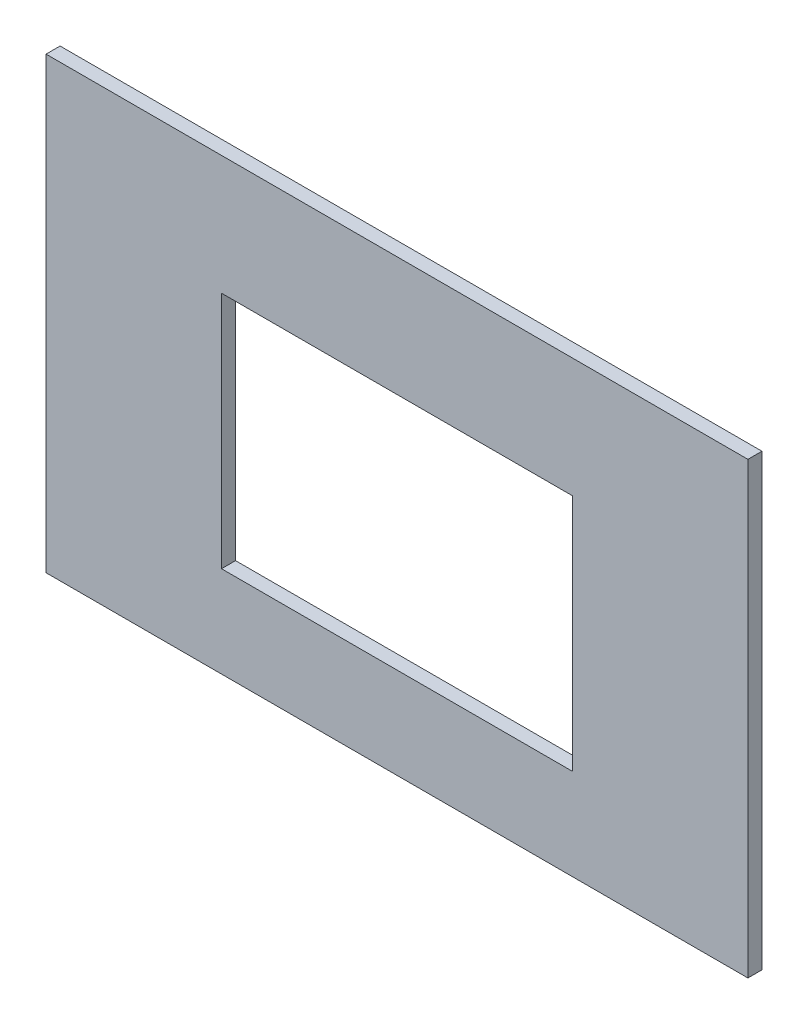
ISO-10303-21;
HEADER;
FILE_DESCRIPTION(('STEP AP214'),'2;1');
FILE_NAME('part.step','',(''),(''),'','','');
FILE_SCHEMA(('AUTOMOTIVE_DESIGN { 1 0 10303 214 1 1 1 1 }'));
ENDSEC;
DATA;
#1=APPLICATION_CONTEXT('core data for automotive mechanical design processes');
#2=APPLICATION_PROTOCOL_DEFINITION('international standard','automotive_design',2000,#1);
#3=PRODUCT_CONTEXT('',#1,'mechanical');
#4=PRODUCT('Part','Part','',(#3));
#5=PRODUCT_RELATED_PRODUCT_CATEGORY('part','',(#4));
#6=PRODUCT_DEFINITION_FORMATION('','',#4);
#7=PRODUCT_DEFINITION_CONTEXT('part definition',#1,'design');
#8=PRODUCT_DEFINITION('design','',#6,#7);
#9=PRODUCT_DEFINITION_SHAPE('','',#8);
#10=(LENGTH_UNIT() NAMED_UNIT(*) SI_UNIT(.MILLI.,.METRE.));
#11=(NAMED_UNIT(*) PLANE_ANGLE_UNIT() SI_UNIT($,.RADIAN.));
#12=(NAMED_UNIT(*) SI_UNIT($,.STERADIAN.) SOLID_ANGLE_UNIT());
#13=UNCERTAINTY_MEASURE_WITH_UNIT(LENGTH_MEASURE(1.E-05),#10,'distance_accuracy_value','');
#14=(GEOMETRIC_REPRESENTATION_CONTEXT(3) GLOBAL_UNCERTAINTY_ASSIGNED_CONTEXT((#13)) GLOBAL_UNIT_ASSIGNED_CONTEXT((#10,
#11,#12)) REPRESENTATION_CONTEXT('',''));
#15=CARTESIAN_POINT('',(0.,0.,0.));
#16=DIRECTION('',(0.,0.,1.));
#17=DIRECTION('',(1.,0.,0.));
#18=AXIS2_PLACEMENT_3D('',#15,#16,#17);
#19=CARTESIAN_POINT('',(0.,0.,6.35));
#20=DIRECTION('',(0.,0.,-1.));
#21=DIRECTION('',(-1.,0.,0.));
#22=AXIS2_PLACEMENT_3D('',#19,#20,#21);
#23=PLANE('',#22);
#24=DIRECTION('',(0.,-1.,0.));
#25=VECTOR('',#24,1.);
#26=CARTESIAN_POINT('',(0.,0.,6.35));
#27=LINE('',#26,#25);
#28=CARTESIAN_POINT('',(0.,203.2,6.35));
#29=VERTEX_POINT('',#28);
#30=CARTESIAN_POINT('',(0.,0.,6.35));
#31=VERTEX_POINT('',#30);
#32=EDGE_CURVE('E165',#29,#31,#27,.T.);
#33=ORIENTED_EDGE('',*,*,#32,.T.);
#34=DIRECTION('',(1.,0.,0.));
#35=VECTOR('',#34,1.);
#36=CARTESIAN_POINT('',(0.,0.,6.35));
#37=LINE('',#36,#35);
#38=CARTESIAN_POINT('',(317.5,0.,6.35));
#39=VERTEX_POINT('',#38);
#40=EDGE_CURVE('E169',#31,#39,#37,.T.);
#41=ORIENTED_EDGE('',*,*,#40,.T.);
#42=DIRECTION('',(0.,1.,0.));
#43=VECTOR('',#42,1.);
#44=CARTESIAN_POINT('',(317.5,0.,6.35));
#45=LINE('',#44,#43);
#46=CARTESIAN_POINT('',(317.5,203.2,6.35));
#47=VERTEX_POINT('',#46);
#48=EDGE_CURVE('E173',#39,#47,#45,.T.);
#49=ORIENTED_EDGE('',*,*,#48,.T.);
#50=DIRECTION('',(-1.,0.,0.));
#51=VECTOR('',#50,1.);
#52=CARTESIAN_POINT('',(0.,203.2,6.35));
#53=LINE('',#52,#51);
#54=EDGE_CURVE('E176',#47,#29,#53,.T.);
#55=ORIENTED_EDGE('',*,*,#54,.T.);
#56=EDGE_LOOP('',(#33,#41,#49,#55));
#57=FACE_BOUND('',#56,.T.);
#58=DIRECTION('',(0.,1.,0.));
#59=VECTOR('',#58,1.);
#60=CARTESIAN_POINT('',(79.375,41.275,6.35));
#61=LINE('',#60,#59);
#62=CARTESIAN_POINT('',(79.375,41.275,6.35));
#63=VERTEX_POINT('',#62);
#64=CARTESIAN_POINT('',(79.375,149.225,6.35));
#65=VERTEX_POINT('',#64);
#66=EDGE_CURVE('E67',#63,#65,#61,.T.);
#67=ORIENTED_EDGE('',*,*,#66,.T.);
#68=DIRECTION('',(1.,0.,0.));
#69=VECTOR('',#68,1.);
#70=CARTESIAN_POINT('',(79.375,149.225,6.35));
#71=LINE('',#70,#69);
#72=CARTESIAN_POINT('',(238.125,149.225,6.35));
#73=VERTEX_POINT('',#72);
#74=EDGE_CURVE('E133',#65,#73,#71,.T.);
#75=ORIENTED_EDGE('',*,*,#74,.T.);
#76=DIRECTION('',(0.,1.,0.));
#77=VECTOR('',#76,1.);
#78=CARTESIAN_POINT('',(238.125,41.275,6.35));
#79=LINE('',#78,#77);
#80=CARTESIAN_POINT('',(238.125,41.275,6.35));
#81=VERTEX_POINT('',#80);
#82=EDGE_CURVE('E151',#81,#73,#79,.T.);
#83=ORIENTED_EDGE('',*,*,#82,.F.);
#84=DIRECTION('',(1.,0.,0.));
#85=VECTOR('',#84,1.);
#86=CARTESIAN_POINT('',(79.375,41.275,6.35));
#87=LINE('',#86,#85);
#88=EDGE_CURVE('E128',#63,#81,#87,.T.);
#89=ORIENTED_EDGE('',*,*,#88,.F.);
#90=EDGE_LOOP('',(#67,#75,#83,#89));
#91=FACE_BOUND('',#90,.T.);
#92=ADVANCED_FACE('F51',(#57,#91),#23,.F.);
#93=CARTESIAN_POINT('',(0.,0.,0.));
#94=DIRECTION('',(0.,0.,-1.));
#95=DIRECTION('',(-1.,0.,0.));
#96=AXIS2_PLACEMENT_3D('',#93,#94,#95);
#97=PLANE('',#96);
#98=DIRECTION('',(0.,-1.,0.));
#99=VECTOR('',#98,1.);
#100=CARTESIAN_POINT('',(0.,0.,0.));
#101=LINE('',#100,#99);
#102=CARTESIAN_POINT('',(0.,203.2,0.));
#103=VERTEX_POINT('',#102);
#104=CARTESIAN_POINT('',(0.,0.,0.));
#105=VERTEX_POINT('',#104);
#106=EDGE_CURVE('E135',#103,#105,#101,.T.);
#107=ORIENTED_EDGE('',*,*,#106,.F.);
#108=DIRECTION('',(-1.,0.,0.));
#109=VECTOR('',#108,1.);
#110=CARTESIAN_POINT('',(0.,203.2,0.));
#111=LINE('',#110,#109);
#112=CARTESIAN_POINT('',(317.5,203.2,0.));
#113=VERTEX_POINT('',#112);
#114=EDGE_CURVE('E170',#113,#103,#111,.T.);
#115=ORIENTED_EDGE('',*,*,#114,.F.);
#116=DIRECTION('',(0.,1.,0.));
#117=VECTOR('',#116,1.);
#118=CARTESIAN_POINT('',(317.5,0.,0.));
#119=LINE('',#118,#117);
#120=CARTESIAN_POINT('',(317.5,0.,0.));
#121=VERTEX_POINT('',#120);
#122=EDGE_CURVE('E186',#121,#113,#119,.T.);
#123=ORIENTED_EDGE('',*,*,#122,.F.);
#124=DIRECTION('',(1.,0.,0.));
#125=VECTOR('',#124,1.);
#126=CARTESIAN_POINT('',(0.,0.,0.));
#127=LINE('',#126,#125);
#128=EDGE_CURVE('E183',#105,#121,#127,.T.);
#129=ORIENTED_EDGE('',*,*,#128,.F.);
#130=EDGE_LOOP('',(#107,#115,#123,#129));
#131=FACE_BOUND('',#130,.T.);
#132=DIRECTION('',(1.,0.,0.));
#133=VECTOR('',#132,1.);
#134=CARTESIAN_POINT('',(79.375,149.225,0.));
#135=LINE('',#134,#133);
#136=CARTESIAN_POINT('',(79.375,149.225,0.));
#137=VERTEX_POINT('',#136);
#138=CARTESIAN_POINT('',(238.125,149.225,0.));
#139=VERTEX_POINT('',#138);
#140=EDGE_CURVE('E127',#137,#139,#135,.T.);
#141=ORIENTED_EDGE('',*,*,#140,.F.);
#142=DIRECTION('',(0.,1.,0.));
#143=VECTOR('',#142,1.);
#144=CARTESIAN_POINT('',(79.375,41.275,0.));
#145=LINE('',#144,#143);
#146=CARTESIAN_POINT('',(79.375,41.275,0.));
#147=VERTEX_POINT('',#146);
#148=EDGE_CURVE('E117',#147,#137,#145,.T.);
#149=ORIENTED_EDGE('',*,*,#148,.F.);
#150=DIRECTION('',(1.,0.,0.));
#151=VECTOR('',#150,1.);
#152=CARTESIAN_POINT('',(79.375,41.275,0.));
#153=LINE('',#152,#151);
#154=CARTESIAN_POINT('',(238.125,41.275,0.));
#155=VERTEX_POINT('',#154);
#156=EDGE_CURVE('E142',#147,#155,#153,.T.);
#157=ORIENTED_EDGE('',*,*,#156,.T.);
#158=DIRECTION('',(0.,1.,0.));
#159=VECTOR('',#158,1.);
#160=CARTESIAN_POINT('',(238.125,41.275,0.));
#161=LINE('',#160,#159);
#162=EDGE_CURVE('E75',#155,#139,#161,.T.);
#163=ORIENTED_EDGE('',*,*,#162,.T.);
#164=EDGE_LOOP('',(#141,#149,#157,#163));
#165=FACE_BOUND('',#164,.T.);
#166=ADVANCED_FACE('F138',(#131,#165),#97,.T.);
#167=CARTESIAN_POINT('',(0.,0.,6.35));
#168=DIRECTION('',(1.,0.,0.));
#169=DIRECTION('',(0.,0.,-1.));
#170=AXIS2_PLACEMENT_3D('',#167,#168,#169);
#171=PLANE('',#170);
#172=ORIENTED_EDGE('',*,*,#106,.T.);
#173=DIRECTION('',(0.,0.,-1.));
#174=VECTOR('',#173,1.);
#175=CARTESIAN_POINT('',(0.,0.,6.35));
#176=LINE('',#175,#174);
#177=EDGE_CURVE('E11',#31,#105,#176,.T.);
#178=ORIENTED_EDGE('',*,*,#177,.F.);
#179=ORIENTED_EDGE('',*,*,#32,.F.);
#180=DIRECTION('',(0.,0.,-1.));
#181=VECTOR('',#180,1.);
#182=CARTESIAN_POINT('',(0.,203.2,6.35));
#183=LINE('',#182,#181);
#184=EDGE_CURVE('E179',#29,#103,#183,.T.);
#185=ORIENTED_EDGE('',*,*,#184,.T.);
#186=EDGE_LOOP('',(#172,#178,#179,#185));
#187=FACE_BOUND('',#186,.T.);
#188=ADVANCED_FACE('F53',(#187),#171,.F.);
#189=CARTESIAN_POINT('',(0.,0.,6.35));
#190=DIRECTION('',(0.,1.,0.));
#191=DIRECTION('',(0.,0.,1.));
#192=AXIS2_PLACEMENT_3D('',#189,#190,#191);
#193=PLANE('',#192);
#194=ORIENTED_EDGE('',*,*,#128,.T.);
#195=DIRECTION('',(0.,0.,-1.));
#196=VECTOR('',#195,1.);
#197=CARTESIAN_POINT('',(317.5,0.,6.35));
#198=LINE('',#197,#196);
#199=EDGE_CURVE('E60',#39,#121,#198,.T.);
#200=ORIENTED_EDGE('',*,*,#199,.F.);
#201=ORIENTED_EDGE('',*,*,#40,.F.);
#202=ORIENTED_EDGE('',*,*,#177,.T.);
#203=EDGE_LOOP('',(#194,#200,#201,#202));
#204=FACE_BOUND('',#203,.T.);
#205=ADVANCED_FACE('F218',(#204),#193,.F.);
#206=CARTESIAN_POINT('',(317.5,0.,6.35));
#207=DIRECTION('',(-1.,0.,0.));
#208=DIRECTION('',(0.,0.,1.));
#209=AXIS2_PLACEMENT_3D('',#206,#207,#208);
#210=PLANE('',#209);
#211=ORIENTED_EDGE('',*,*,#122,.T.);
#212=DIRECTION('',(0.,0.,-1.));
#213=VECTOR('',#212,1.);
#214=CARTESIAN_POINT('',(317.5,203.2,6.35));
#215=LINE('',#214,#213);
#216=EDGE_CURVE('E194',#47,#113,#215,.T.);
#217=ORIENTED_EDGE('',*,*,#216,.F.);
#218=ORIENTED_EDGE('',*,*,#48,.F.);
#219=ORIENTED_EDGE('',*,*,#199,.T.);
#220=EDGE_LOOP('',(#211,#217,#218,#219));
#221=FACE_BOUND('',#220,.T.);
#222=ADVANCED_FACE('F203',(#221),#210,.F.);
#223=CARTESIAN_POINT('',(0.,203.2,6.35));
#224=DIRECTION('',(0.,-1.,0.));
#225=DIRECTION('',(0.,0.,-1.));
#226=AXIS2_PLACEMENT_3D('',#223,#224,#225);
#227=PLANE('',#226);
#228=ORIENTED_EDGE('',*,*,#114,.T.);
#229=ORIENTED_EDGE('',*,*,#184,.F.);
#230=ORIENTED_EDGE('',*,*,#54,.F.);
#231=ORIENTED_EDGE('',*,*,#216,.T.);
#232=EDGE_LOOP('',(#228,#229,#230,#231));
#233=FACE_BOUND('',#232,.T.);
#234=ADVANCED_FACE('F211',(#233),#227,.F.);
#235=CARTESIAN_POINT('',(79.375,41.275,0.));
#236=DIRECTION('',(1.,0.,0.));
#237=DIRECTION('',(0.,0.,-1.));
#238=AXIS2_PLACEMENT_3D('',#235,#236,#237);
#239=PLANE('',#238);
#240=ORIENTED_EDGE('',*,*,#66,.F.);
#241=DIRECTION('',(0.,0.,1.));
#242=VECTOR('',#241,1.);
#243=CARTESIAN_POINT('',(79.375,41.275,0.));
#244=LINE('',#243,#242);
#245=EDGE_CURVE('E121',#147,#63,#244,.T.);
#246=ORIENTED_EDGE('',*,*,#245,.F.);
#247=ORIENTED_EDGE('',*,*,#148,.T.);
#248=DIRECTION('',(0.,0.,1.));
#249=VECTOR('',#248,1.);
#250=CARTESIAN_POINT('',(79.375,149.225,0.));
#251=LINE('',#250,#249);
#252=EDGE_CURVE('E120',#137,#65,#251,.T.);
#253=ORIENTED_EDGE('',*,*,#252,.T.);
#254=EDGE_LOOP('',(#240,#246,#247,#253));
#255=FACE_BOUND('',#254,.T.);
#256=ADVANCED_FACE('F119',(#255),#239,.T.);
#257=CARTESIAN_POINT('',(79.375,149.225,0.));
#258=DIRECTION('',(0.,-1.,0.));
#259=DIRECTION('',(0.,0.,-1.));
#260=AXIS2_PLACEMENT_3D('',#257,#258,#259);
#261=PLANE('',#260);
#262=ORIENTED_EDGE('',*,*,#74,.F.);
#263=ORIENTED_EDGE('',*,*,#252,.F.);
#264=ORIENTED_EDGE('',*,*,#140,.T.);
#265=DIRECTION('',(0.,0.,1.));
#266=VECTOR('',#265,1.);
#267=CARTESIAN_POINT('',(238.125,149.225,0.));
#268=LINE('',#267,#266);
#269=EDGE_CURVE('E136',#139,#73,#268,.T.);
#270=ORIENTED_EDGE('',*,*,#269,.T.);
#271=EDGE_LOOP('',(#262,#263,#264,#270));
#272=FACE_BOUND('',#271,.T.);
#273=ADVANCED_FACE('F131',(#272),#261,.T.);
#274=CARTESIAN_POINT('',(238.125,41.275,0.));
#275=DIRECTION('',(1.,0.,0.));
#276=DIRECTION('',(0.,0.,-1.));
#277=AXIS2_PLACEMENT_3D('',#274,#275,#276);
#278=PLANE('',#277);
#279=ORIENTED_EDGE('',*,*,#82,.T.);
#280=ORIENTED_EDGE('',*,*,#269,.F.);
#281=ORIENTED_EDGE('',*,*,#162,.F.);
#282=DIRECTION('',(0.,0.,1.));
#283=VECTOR('',#282,1.);
#284=CARTESIAN_POINT('',(238.125,41.275,0.));
#285=LINE('',#284,#283);
#286=EDGE_CURVE('E160',#155,#81,#285,.T.);
#287=ORIENTED_EDGE('',*,*,#286,.T.);
#288=EDGE_LOOP('',(#279,#280,#281,#287));
#289=FACE_BOUND('',#288,.T.);
#290=ADVANCED_FACE('F242',(#289),#278,.F.);
#291=CARTESIAN_POINT('',(79.375,41.275,0.));
#292=DIRECTION('',(0.,-1.,0.));
#293=DIRECTION('',(0.,0.,-1.));
#294=AXIS2_PLACEMENT_3D('',#291,#292,#293);
#295=PLANE('',#294);
#296=ORIENTED_EDGE('',*,*,#88,.T.);
#297=ORIENTED_EDGE('',*,*,#286,.F.);
#298=ORIENTED_EDGE('',*,*,#156,.F.);
#299=ORIENTED_EDGE('',*,*,#245,.T.);
#300=EDGE_LOOP('',(#296,#297,#298,#299));
#301=FACE_BOUND('',#300,.T.);
#302=ADVANCED_FACE('F246',(#301),#295,.F.);
#303=CLOSED_SHELL('',(#92,#166,#188,#205,#222,#234,#256,#273,#290,#302));
#304=MANIFOLD_SOLID_BREP('B2',#303);
#305=ADVANCED_BREP_SHAPE_REPRESENTATION('',(#18,#304),#14);
#306=SHAPE_DEFINITION_REPRESENTATION(#9,#305);
ENDSEC;
END-ISO-10303-21;
